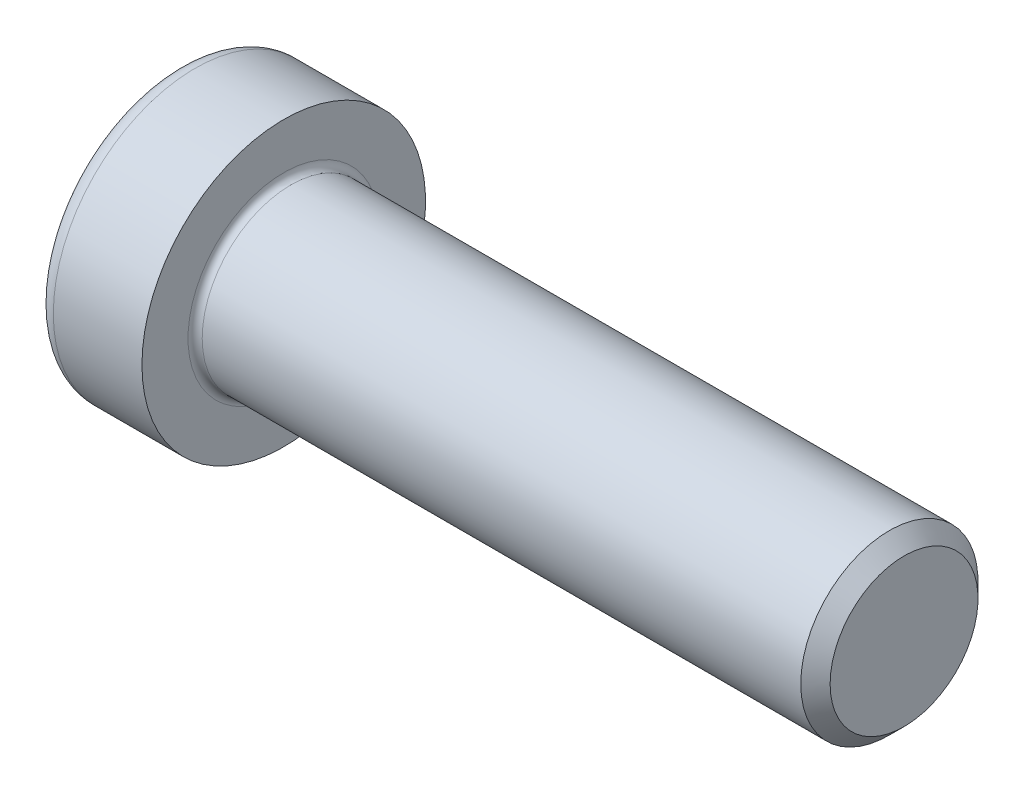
from build123d import *

# Parameters (mm, degrees)
FILLET1_R   = 0.4
FILLET2_R   = 1
HEX_2_DEPTH = 4.5


with BuildPart() as part:
    # BodySke → Base-Revolve (revolve)
    with BuildSketch(Plane.XY, mode=Mode.PRIVATE) as base_revolve_sk:
        Polygon((0, 0), (0, 8), (6, 8), (6, 5), (40.172, 5), (41, 4.172), (41, 0), align=None)
    revolve(base_revolve_sk.sketch.rotate(Axis((-31.75, 0, 0), (1, 0, 0)), 90), axis=Axis((-31.75, 0, 0), (1, 0, 0)))

    # Fillet1
    fillet1_edges = [part.edges().sort_by_distance(p)[0] for p in [
        (6, 0, -5),
    ]]
    fillet(fillet1_edges, radius=FILLET1_R)

    # Fillet2
    fillet2_edges = [part.edges().sort_by_distance(p)[0] for p in [
        (0, 0, -8),
    ]]
    fillet(fillet2_edges, radius=FILLET2_R)

    # Sketch2 → Hex-PreBroach (revolve, cut)
    with BuildSketch(Plane.XY, mode=Mode.PRIVATE) as hex_prebroach_sk:
        Polygon((0, 3.5), (4.5, 3.5), (6.520725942, 0), (0, 0), align=None)
    revolve(hex_prebroach_sk.sketch.rotate(Axis((0, 0, 0), (1, 0, 0)), 90), axis=Axis((0, 0, 0), (1, 0, 0)), mode=Mode.SUBTRACT)

    # Sketch3 → Hex 2 (cut)
    with BuildSketch(Plane(origin=(0, 0, 0), x_dir=(0, 0.500000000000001, 0.866025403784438), z_dir=(-1, 0, 0))):
        Polygon((2.020725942, 3.5), (-2.020725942, 3.5), (-4.041451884, 0), (-2.020725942, -3.5), (2.020725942, -3.5), (4.041451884, 0), align=None)
    extrude(amount=-HEX_2_DEPTH, mode=Mode.SUBTRACT)


solid = part.part
